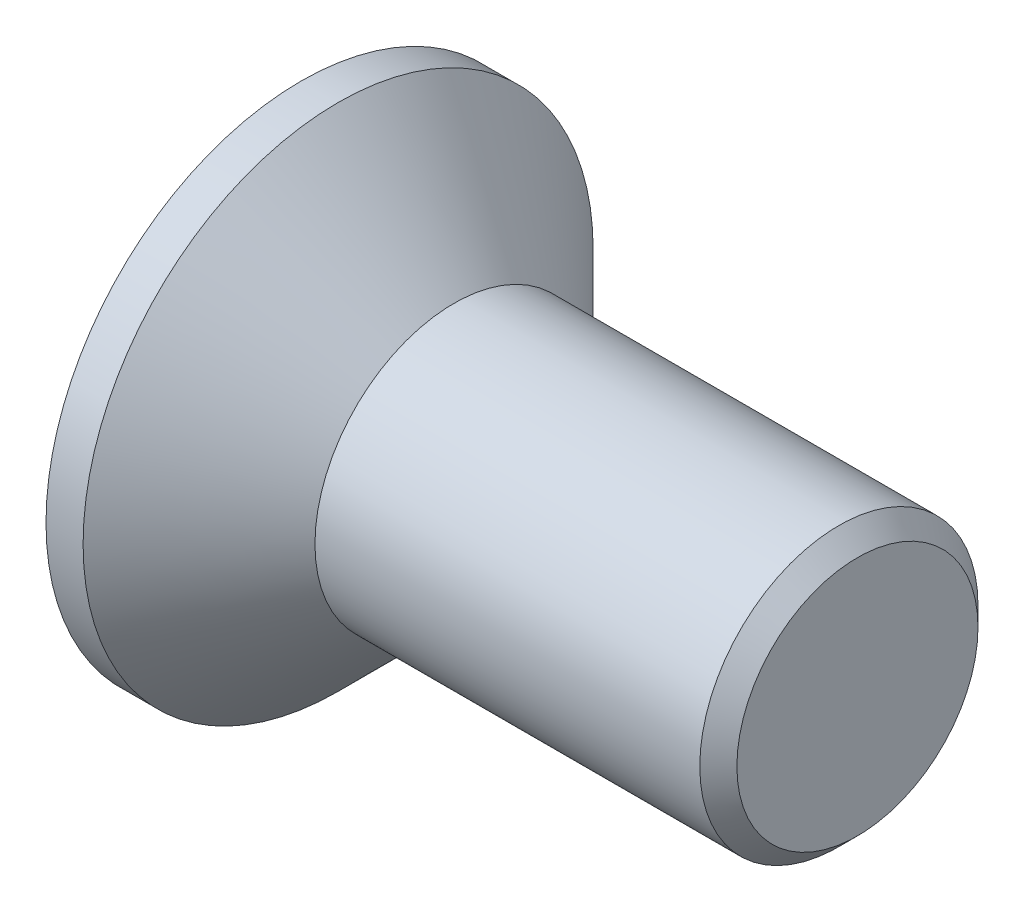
from build123d import *

# Parameters (mm, degrees)
SCHNITT_LINEAR_AUSTRAGEN1_DEPTH = 0.83


with BuildPart() as part:
    # Skizze1 → Rotation1 (revolve)
    with BuildSketch(Plane.XY, mode=Mode.PRIVATE) as rotation1_sk:
        Polygon((0, 1.4), (0, 2.75), (0.4, 2.75), (1.65, 1.5), (5.8, 1.5), (6, 1.3), (6, 0), (0.375128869, 0), align=None)
    revolve(rotation1_sk.sketch.rotate(Axis((0, 0, 0), (1, 0, 0)), 90), axis=Axis((0, 0, 0), (1, 0, 0)))

    # Skizze2 → Schnitt-Linear austragen1 (cut)
    with BuildSketch(Plane.ZY):
        with BuildLine():
            ThreePointArc((0.272443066, 1.184612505), (0, 1.4), (-0.272443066, 1.184612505))
            ThreePointArc((-0.272443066, 1.184612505), (-0.504218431, 0.873331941), (-0.88968299, 0.828248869))
            ThreePointArc((-0.88968299, 0.828248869), (-1.212435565, 0.7), (-1.162126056, 0.356363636))
            ThreePointArc((-1.162126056, 0.356363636), (-1.008436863, 0), (-1.162126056, -0.356363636))
            ThreePointArc((-1.162126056, -0.356363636), (-1.212435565, -0.7), (-0.88968299, -0.828248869))
            ThreePointArc((-0.88968299, -0.828248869), (-0.504218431, -0.873331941), (-0.272443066, -1.184612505))
            ThreePointArc((-0.272443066, -1.184612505), (0, -1.4), (0.272443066, -1.184612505))
            ThreePointArc((0.272443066, -1.184612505), (0.504218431, -0.873331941), (0.88968299, -0.828248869))
            ThreePointArc((0.88968299, -0.828248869), (1.212435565, -0.7), (1.162126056, -0.356363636))
            ThreePointArc((1.162126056, -0.356363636), (1.008436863, 0), (1.162126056, 0.356363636))
            ThreePointArc((1.162126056, 0.356363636), (1.212435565, 0.7), (0.88968299, 0.828248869))
            ThreePointArc((0.88968299, 0.828248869), (0.504218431, 0.873331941), (0.272443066, 1.184612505))
        make_face()
    extrude(amount=-SCHNITT_LINEAR_AUSTRAGEN1_DEPTH, mode=Mode.SUBTRACT)


solid = part.part
